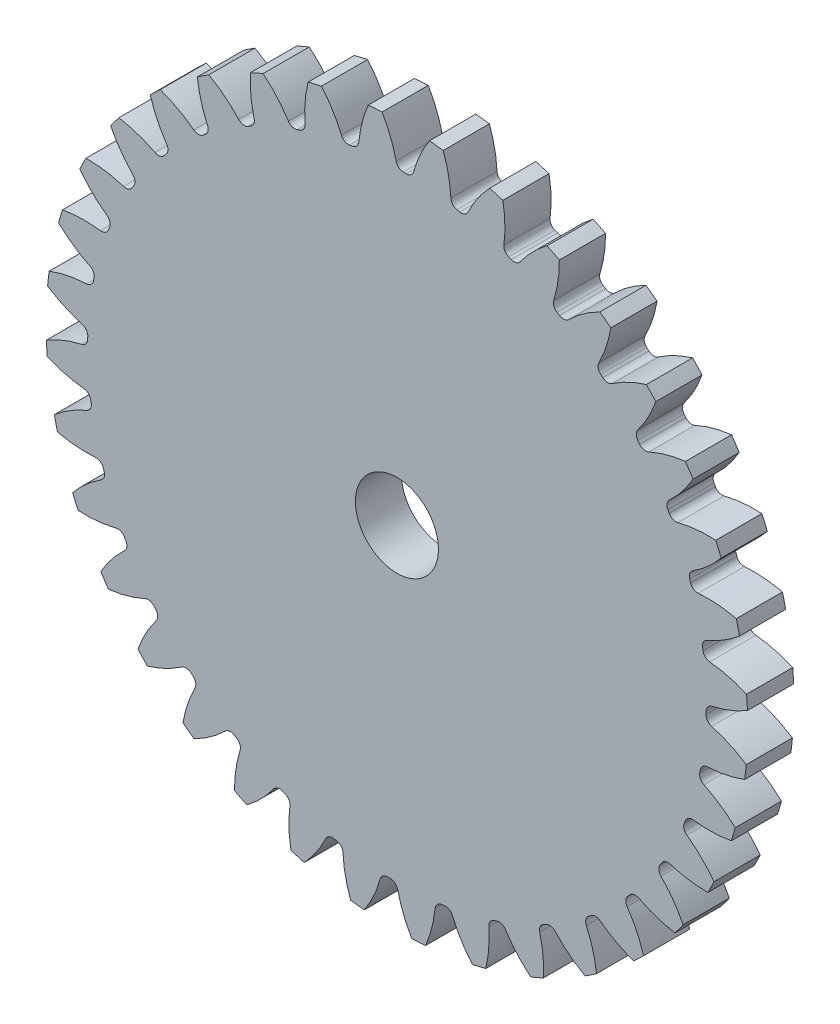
from build123d import *

# Parameters (mm, degrees)
SKETCH3_R         = 965.2
GEARBODY_DEPTH    = 127
TOOTHCUT_DEPTH    = 1371.894262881
CIRPATTERN1_COUNT = 36
BOREDIA_R         = 114.3
BORE_DEPTH        = 12700


with BuildPart() as part:
    # Sketch3 → gearBody (new body)
    with BuildSketch(Plane.XY):
        Circle(SKETCH3_R)
    extrude(amount=GEARBODY_DEPTH)

    # Sketch2 → toothCut (cut, through all)
    with BuildSketch(Plane.XY):
        with BuildLine():
            ThreePointArc((850.517323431, -25.51651511), (850.627013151, -21.552134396), (850.718224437, -17.587285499))
            ThreePointArc((850.718224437, -17.587285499), (855.387754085, -4.921596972), (866.878386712, 2.162860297))
            ThreePointArc((866.878386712, 2.162860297), (917.594923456, 17.813392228), (965.2, 41.283861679))
            ThreePointArc((965.2, 41.283861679), (965.772560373, -24.46954975), (961.870915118, -90.109599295))
            ThreePointArc((961.870915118, -90.109599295), (915.515488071, -64.258474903), (865.656583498, -46.059686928))
            ThreePointArc((865.656583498, -46.059686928), (854.539458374, -38.402422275), (850.517323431, -25.51651511))
        make_face()
    toothcut = extrude(amount=TOOTHCUT_DEPTH, mode=Mode.SUBTRACT)

    # CirPattern1: toothCut ×36 about axis
    cirpattern1_axis = Axis((0, 0, 0), (0, 0, 1))
    for i in range(1, CIRPATTERN1_COUNT):
        add(toothcut.rotate(cirpattern1_axis, i * 360 / CIRPATTERN1_COUNT), mode=Mode.SUBTRACT)

    # boreDia → bore (cut, symmetric)
    with BuildSketch(Plane.XY):
        Circle(BOREDIA_R)
    extrude(amount=BORE_DEPTH, both=True, mode=Mode.SUBTRACT)


solid = part.part
